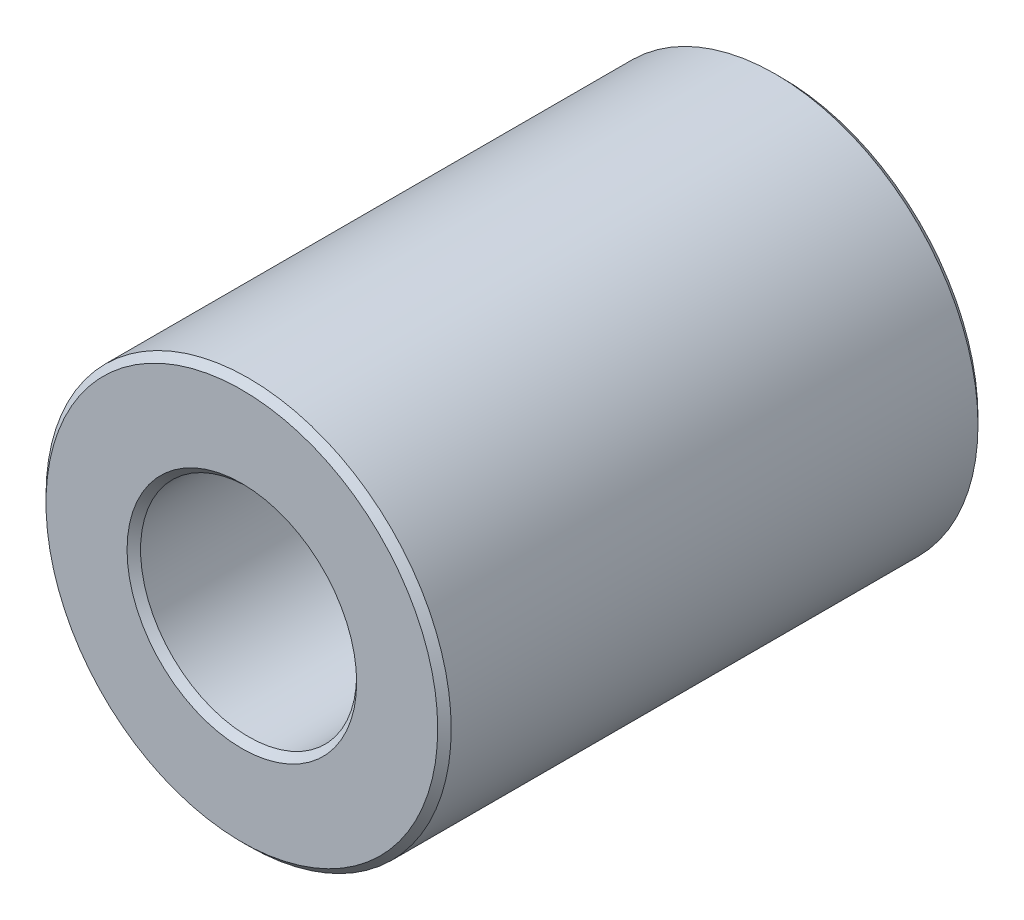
ISO-10303-21;
HEADER;
FILE_DESCRIPTION(('STEP AP214'),'2;1');
FILE_NAME('part.step','',(''),(''),'','','');
FILE_SCHEMA(('AUTOMOTIVE_DESIGN { 1 0 10303 214 1 1 1 1 }'));
ENDSEC;
DATA;
#1=APPLICATION_CONTEXT('core data for automotive mechanical design processes');
#2=APPLICATION_PROTOCOL_DEFINITION('international standard','automotive_design',2000,#1);
#3=PRODUCT_CONTEXT('',#1,'mechanical');
#4=PRODUCT('Part','Part','',(#3));
#5=PRODUCT_RELATED_PRODUCT_CATEGORY('part','',(#4));
#6=PRODUCT_DEFINITION_FORMATION('','',#4);
#7=PRODUCT_DEFINITION_CONTEXT('part definition',#1,'design');
#8=PRODUCT_DEFINITION('design','',#6,#7);
#9=PRODUCT_DEFINITION_SHAPE('','',#8);
#10=(LENGTH_UNIT() NAMED_UNIT(*) SI_UNIT(.MILLI.,.METRE.));
#11=(NAMED_UNIT(*) PLANE_ANGLE_UNIT() SI_UNIT($,.RADIAN.));
#12=(NAMED_UNIT(*) SI_UNIT($,.STERADIAN.) SOLID_ANGLE_UNIT());
#13=UNCERTAINTY_MEASURE_WITH_UNIT(LENGTH_MEASURE(1.E-05),#10,'distance_accuracy_value','');
#14=(GEOMETRIC_REPRESENTATION_CONTEXT(3) GLOBAL_UNCERTAINTY_ASSIGNED_CONTEXT((#13)) GLOBAL_UNIT_ASSIGNED_CONTEXT((#10,
#11,#12)) REPRESENTATION_CONTEXT('',''));
#15=CARTESIAN_POINT('',(0.,0.,0.));
#16=DIRECTION('',(0.,0.,1.));
#17=DIRECTION('',(1.,0.,0.));
#18=AXIS2_PLACEMENT_3D('',#15,#16,#17);
#19=CARTESIAN_POINT('',(0.,0.,4.));
#20=DIRECTION('',(0.,0.,1.));
#21=DIRECTION('',(1.,0.,0.));
#22=AXIS2_PLACEMENT_3D('',#19,#20,#21);
#23=PLANE('',#22);
#24=CARTESIAN_POINT('',(0.,0.,4.));
#25=DIRECTION('',(0.,0.,1.));
#26=DIRECTION('',(1.,0.,0.));
#27=AXIS2_PLACEMENT_3D('',#24,#25,#26);
#28=CIRCLE('',#27,1.7);
#29=CARTESIAN_POINT('',(1.7,0.,4.));
#30=VERTEX_POINT('',#29);
#31=EDGE_CURVE('E10',#30,#30,#28,.F.);
#32=ORIENTED_EDGE('',*,*,#31,.T.);
#33=EDGE_LOOP('',(#32));
#34=FACE_BOUND('',#33,.T.);
#35=CARTESIAN_POINT('',(0.,0.,4.));
#36=DIRECTION('',(0.,0.,1.));
#37=DIRECTION('',(1.,0.,0.));
#38=AXIS2_PLACEMENT_3D('',#35,#36,#37);
#39=CIRCLE('',#38,2.9);
#40=CARTESIAN_POINT('',(2.9,0.,4.));
#41=VERTEX_POINT('',#40);
#42=EDGE_CURVE('E45',#41,#41,#39,.T.);
#43=ORIENTED_EDGE('',*,*,#42,.T.);
#44=EDGE_LOOP('',(#43));
#45=FACE_BOUND('',#44,.T.);
#46=ADVANCED_FACE('F37',(#34,#45),#23,.T.);
#47=CARTESIAN_POINT('',(0.,0.,-4.));
#48=DIRECTION('',(0.,0.,1.));
#49=DIRECTION('',(1.,0.,0.));
#50=AXIS2_PLACEMENT_3D('',#47,#48,#49);
#51=PLANE('',#50);
#52=CARTESIAN_POINT('',(0.,0.,-4.));
#53=DIRECTION('',(0.,0.,1.));
#54=DIRECTION('',(1.,0.,0.));
#55=AXIS2_PLACEMENT_3D('',#52,#53,#54);
#56=CIRCLE('',#55,2.9);
#57=CARTESIAN_POINT('',(2.9,0.,-4.));
#58=VERTEX_POINT('',#57);
#59=EDGE_CURVE('E62',#58,#58,#56,.F.);
#60=ORIENTED_EDGE('',*,*,#59,.T.);
#61=EDGE_LOOP('',(#60));
#62=FACE_BOUND('',#61,.T.);
#63=CARTESIAN_POINT('',(0.,0.,-4.));
#64=DIRECTION('',(0.,0.,1.));
#65=DIRECTION('',(1.,0.,0.));
#66=AXIS2_PLACEMENT_3D('',#63,#64,#65);
#67=CIRCLE('',#66,1.7);
#68=CARTESIAN_POINT('',(1.7,0.,-4.));
#69=VERTEX_POINT('',#68);
#70=EDGE_CURVE('E66',#69,#69,#67,.T.);
#71=ORIENTED_EDGE('',*,*,#70,.T.);
#72=EDGE_LOOP('',(#71));
#73=FACE_BOUND('',#72,.T.);
#74=ADVANCED_FACE('F89',(#62,#73),#51,.F.);
#75=CARTESIAN_POINT('',(0.,0.,4.));
#76=DIRECTION('',(0.,0.,-1.));
#77=DIRECTION('',(-1.,0.,0.));
#78=AXIS2_PLACEMENT_3D('',#75,#76,#77);
#79=CYLINDRICAL_SURFACE('',#78,3.);
#80=CARTESIAN_POINT('',(0.,0.,-3.9));
#81=DIRECTION('',(0.,0.,1.));
#82=DIRECTION('',(1.,0.,0.));
#83=AXIS2_PLACEMENT_3D('',#80,#81,#82);
#84=CIRCLE('',#83,3.);
#85=CARTESIAN_POINT('',(3.,0.,-3.9));
#86=VERTEX_POINT('',#85);
#87=EDGE_CURVE('E70',#86,#86,#84,.T.);
#88=ORIENTED_EDGE('',*,*,#87,.T.);
#89=EDGE_LOOP('',(#88));
#90=FACE_BOUND('',#89,.T.);
#91=CARTESIAN_POINT('',(0.,0.,3.9));
#92=DIRECTION('',(0.,0.,1.));
#93=DIRECTION('',(1.,0.,0.));
#94=AXIS2_PLACEMENT_3D('',#91,#92,#93);
#95=CIRCLE('',#94,3.);
#96=CARTESIAN_POINT('',(3.,0.,3.9));
#97=VERTEX_POINT('',#96);
#98=EDGE_CURVE('E73',#97,#97,#95,.F.);
#99=ORIENTED_EDGE('',*,*,#98,.T.);
#100=EDGE_LOOP('',(#99));
#101=FACE_BOUND('',#100,.T.);
#102=ADVANCED_FACE('F78',(#90,#101),#79,.T.);
#103=CARTESIAN_POINT('',(0.,0.,4.));
#104=DIRECTION('',(0.,0.,-1.));
#105=DIRECTION('',(-1.,0.,0.));
#106=AXIS2_PLACEMENT_3D('',#103,#104,#105);
#107=CYLINDRICAL_SURFACE('',#106,1.6);
#108=CARTESIAN_POINT('',(0.,0.,-3.9));
#109=DIRECTION('',(0.,0.,1.));
#110=DIRECTION('',(1.,0.,0.));
#111=AXIS2_PLACEMENT_3D('',#108,#109,#110);
#112=CIRCLE('',#111,1.6);
#113=CARTESIAN_POINT('',(1.6,0.,-3.9));
#114=VERTEX_POINT('',#113);
#115=EDGE_CURVE('E52',#114,#114,#112,.F.);
#116=ORIENTED_EDGE('',*,*,#115,.T.);
#117=EDGE_LOOP('',(#116));
#118=FACE_BOUND('',#117,.T.);
#119=CARTESIAN_POINT('',(0.,0.,3.9));
#120=DIRECTION('',(0.,0.,1.));
#121=DIRECTION('',(1.,0.,0.));
#122=AXIS2_PLACEMENT_3D('',#119,#120,#121);
#123=CIRCLE('',#122,1.6);
#124=CARTESIAN_POINT('',(1.6,0.,3.9));
#125=VERTEX_POINT('',#124);
#126=EDGE_CURVE('E57',#125,#125,#123,.T.);
#127=ORIENTED_EDGE('',*,*,#126,.T.);
#128=EDGE_LOOP('',(#127));
#129=FACE_BOUND('',#128,.T.);
#130=ADVANCED_FACE('F97',(#118,#129),#107,.F.);
#131=CARTESIAN_POINT('',(0.,0.,-3.9));
#132=DIRECTION('',(0.,0.,1.));
#133=DIRECTION('',(1.,0.,0.));
#134=AXIS2_PLACEMENT_3D('',#131,#132,#133);
#135=CONICAL_SURFACE('',#134,3.,0.78539816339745);
#136=ORIENTED_EDGE('',*,*,#59,.F.);
#137=EDGE_LOOP('',(#136));
#138=FACE_BOUND('',#137,.T.);
#139=ORIENTED_EDGE('',*,*,#87,.F.);
#140=EDGE_LOOP('',(#139));
#141=FACE_BOUND('',#140,.T.);
#142=ADVANCED_FACE('F102',(#138,#141),#135,.T.);
#143=CARTESIAN_POINT('',(0.,0.,-4.));
#144=DIRECTION('',(0.,0.,-1.));
#145=DIRECTION('',(-1.,0.,0.));
#146=AXIS2_PLACEMENT_3D('',#143,#144,#145);
#147=CONICAL_SURFACE('',#146,1.7,0.785398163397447);
#148=ORIENTED_EDGE('',*,*,#115,.F.);
#149=EDGE_LOOP('',(#148));
#150=FACE_BOUND('',#149,.T.);
#151=ORIENTED_EDGE('',*,*,#70,.F.);
#152=EDGE_LOOP('',(#151));
#153=FACE_BOUND('',#152,.T.);
#154=ADVANCED_FACE('F86',(#150,#153),#147,.F.);
#155=CARTESIAN_POINT('',(0.,0.,3.9));
#156=DIRECTION('',(0.,0.,1.));
#157=DIRECTION('',(1.,0.,0.));
#158=AXIS2_PLACEMENT_3D('',#155,#156,#157);
#159=CONICAL_SURFACE('',#158,1.6,0.785398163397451);
#160=ORIENTED_EDGE('',*,*,#31,.F.);
#161=EDGE_LOOP('',(#160));
#162=FACE_BOUND('',#161,.T.);
#163=ORIENTED_EDGE('',*,*,#126,.F.);
#164=EDGE_LOOP('',(#163));
#165=FACE_BOUND('',#164,.T.);
#166=ADVANCED_FACE('F82',(#162,#165),#159,.F.);
#167=CARTESIAN_POINT('',(0.,0.,4.));
#168=DIRECTION('',(0.,0.,-1.));
#169=DIRECTION('',(-1.,0.,0.));
#170=AXIS2_PLACEMENT_3D('',#167,#168,#169);
#171=CONICAL_SURFACE('',#170,2.9,0.785398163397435);
#172=ORIENTED_EDGE('',*,*,#98,.F.);
#173=EDGE_LOOP('',(#172));
#174=FACE_BOUND('',#173,.T.);
#175=ORIENTED_EDGE('',*,*,#42,.F.);
#176=EDGE_LOOP('',(#175));
#177=FACE_BOUND('',#176,.T.);
#178=ADVANCED_FACE('F39',(#174,#177),#171,.T.);
#179=CLOSED_SHELL('',(#46,#74,#102,#130,#142,#154,#166,#178));
#180=MANIFOLD_SOLID_BREP('B2',#179);
#181=ADVANCED_BREP_SHAPE_REPRESENTATION('',(#18,#180),#14);
#182=SHAPE_DEFINITION_REPRESENTATION(#9,#181);
ENDSEC;
END-ISO-10303-21;
